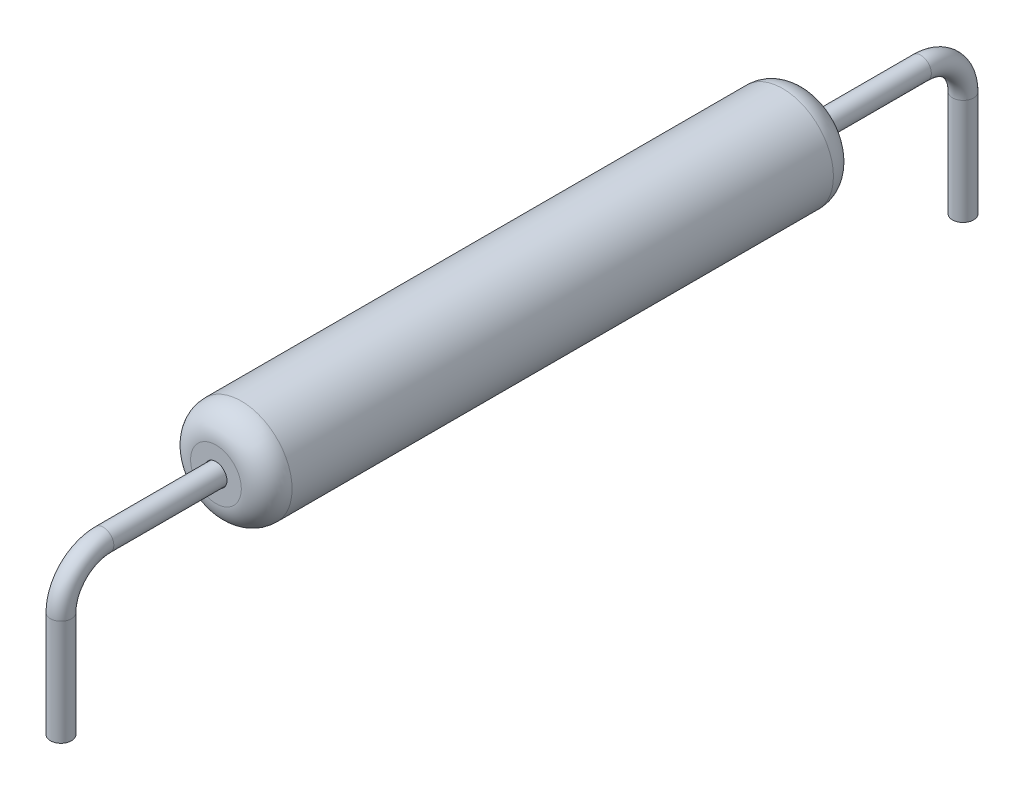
ISO-10303-21;
HEADER;
FILE_DESCRIPTION(('STEP AP214'),'2;1');
FILE_NAME('part.step','',(''),(''),'','','');
FILE_SCHEMA(('AUTOMOTIVE_DESIGN { 1 0 10303 214 1 1 1 1 }'));
ENDSEC;
DATA;
#1=APPLICATION_CONTEXT('core data for automotive mechanical design processes');
#2=APPLICATION_PROTOCOL_DEFINITION('international standard','automotive_design',2000,#1);
#3=PRODUCT_CONTEXT('',#1,'mechanical');
#4=PRODUCT('Part','Part','',(#3));
#5=PRODUCT_RELATED_PRODUCT_CATEGORY('part','',(#4));
#6=PRODUCT_DEFINITION_FORMATION('','',#4);
#7=PRODUCT_DEFINITION_CONTEXT('part definition',#1,'design');
#8=PRODUCT_DEFINITION('design','',#6,#7);
#9=PRODUCT_DEFINITION_SHAPE('','',#8);
#10=(LENGTH_UNIT() NAMED_UNIT(*) SI_UNIT(.MILLI.,.METRE.));
#11=(NAMED_UNIT(*) PLANE_ANGLE_UNIT() SI_UNIT($,.RADIAN.));
#12=(NAMED_UNIT(*) SI_UNIT($,.STERADIAN.) SOLID_ANGLE_UNIT());
#13=UNCERTAINTY_MEASURE_WITH_UNIT(LENGTH_MEASURE(1.E-05),#10,'distance_accuracy_value','');
#14=(GEOMETRIC_REPRESENTATION_CONTEXT(3) GLOBAL_UNCERTAINTY_ASSIGNED_CONTEXT((#13)) GLOBAL_UNIT_ASSIGNED_CONTEXT((#10,
#11,#12)) REPRESENTATION_CONTEXT('',''));
#15=CARTESIAN_POINT('',(0.,0.,0.));
#16=DIRECTION('',(0.,0.,1.));
#17=DIRECTION('',(1.,0.,0.));
#18=AXIS2_PLACEMENT_3D('',#15,#16,#17);
#19=CARTESIAN_POINT('',(0.,-1.00000000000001,17.665));
#20=DIRECTION('',(0.,-1.,0.));
#21=DIRECTION('',(0.,0.,-1.));
#22=AXIS2_PLACEMENT_3D('',#19,#20,#21);
#23=CYLINDRICAL_SURFACE('',#22,0.25);
#24=CARTESIAN_POINT('',(0.,-1.00000000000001,17.665));
#25=DIRECTION('',(0.,-1.,0.));
#26=DIRECTION('',(1.,0.,0.));
#27=AXIS2_PLACEMENT_3D('',#24,#25,#26);
#28=CIRCLE('',#27,0.25);
#29=CARTESIAN_POINT('',(0.,-1.00000000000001,17.915));
#30=VERTEX_POINT('',#29);
#31=EDGE_CURVE('E43',#30,#30,#28,.T.);
#32=ORIENTED_EDGE('',*,*,#31,.T.);
#33=EDGE_LOOP('',(#32));
#34=FACE_BOUND('',#33,.T.);
#35=CARTESIAN_POINT('',(0.,-3.5,17.665));
#36=DIRECTION('',(0.,-1.,0.));
#37=DIRECTION('',(1.,0.,0.));
#38=AXIS2_PLACEMENT_3D('',#35,#36,#37);
#39=CIRCLE('',#38,0.25);
#40=CARTESIAN_POINT('',(0.25,-3.5,17.665));
#41=VERTEX_POINT('',#40);
#42=EDGE_CURVE('E11',#41,#41,#39,.T.);
#43=ORIENTED_EDGE('',*,*,#42,.F.);
#44=EDGE_LOOP('',(#43));
#45=FACE_BOUND('',#44,.T.);
#46=ADVANCED_FACE('F37',(#34,#45),#23,.T.);
#47=CARTESIAN_POINT('',(0.,-1.,16.665));
#48=DIRECTION('',(1.,0.,0.));
#49=DIRECTION('',(0.,0.,-1.));
#50=AXIS2_PLACEMENT_3D('',#47,#48,#49);
#51=TOROIDAL_SURFACE('',#50,1.,0.25);
#52=CARTESIAN_POINT('',(0.,0.,16.665));
#53=DIRECTION('',(0.,0.,1.));
#54=DIRECTION('',(1.,0.,0.));
#55=AXIS2_PLACEMENT_3D('',#52,#53,#54);
#56=CIRCLE('',#55,0.25);
#57=CARTESIAN_POINT('',(0.,0.25,16.665));
#58=VERTEX_POINT('',#57);
#59=EDGE_CURVE('E47',#58,#58,#56,.T.);
#60=CARTESIAN_POINT('',(0.,-1.,16.665));
#61=DIRECTION('',(1.,0.,0.));
#62=DIRECTION('',(0.,0.,-1.));
#63=AXIS2_PLACEMENT_3D('',#60,#61,#62);
#64=CIRCLE('',#63,1.25);
#65=EDGE_CURVE('',#58,#30,#64,.T.);
#66=ORIENTED_EDGE('',*,*,#59,.T.);
#67=ORIENTED_EDGE('',*,*,#31,.F.);
#68=ORIENTED_EDGE('',*,*,#65,.T.);
#69=ORIENTED_EDGE('',*,*,#65,.F.);
#70=EDGE_LOOP('',(#66,#68,#67,#69));
#71=FACE_BOUND('',#70,.T.);
#72=ADVANCED_FACE('F84',(#71),#51,.T.);
#73=CARTESIAN_POINT('',(0.,0.,16.665));
#74=DIRECTION('',(0.,0.,-1.));
#75=DIRECTION('',(-1.,0.,0.));
#76=AXIS2_PLACEMENT_3D('',#73,#74,#75);
#77=CYLINDRICAL_SURFACE('',#76,0.25);
#78=ORIENTED_EDGE('',*,*,#59,.F.);
#79=EDGE_LOOP('',(#78));
#80=FACE_BOUND('',#79,.T.);
#81=CARTESIAN_POINT('',(0.,0.,-2.66499999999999));
#82=DIRECTION('',(0.,0.,1.));
#83=DIRECTION('',(1.,0.,0.));
#84=AXIS2_PLACEMENT_3D('',#81,#82,#83);
#85=CIRCLE('',#84,0.25);
#86=CARTESIAN_POINT('',(0.,0.25,-2.66499999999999));
#87=VERTEX_POINT('',#86);
#88=EDGE_CURVE('E59',#87,#87,#85,.T.);
#89=ORIENTED_EDGE('',*,*,#88,.T.);
#90=EDGE_LOOP('',(#89));
#91=FACE_BOUND('',#90,.T.);
#92=ADVANCED_FACE('F63',(#80,#91),#77,.T.);
#93=CARTESIAN_POINT('',(0.,-3.5,17.665));
#94=DIRECTION('',(0.,-1.,0.));
#95=DIRECTION('',(1.,0.,0.));
#96=AXIS2_PLACEMENT_3D('',#93,#94,#95);
#97=PLANE('',#96);
#98=ORIENTED_EDGE('',*,*,#42,.T.);
#99=EDGE_LOOP('',(#98));
#100=FACE_BOUND('',#99,.T.);
#101=ADVANCED_FACE('F75',(#100),#97,.T.);
#102=CARTESIAN_POINT('',(0.,-1.00000000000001,-3.665));
#103=DIRECTION('',(0.,-1.,0.));
#104=DIRECTION('',(0.,0.,-1.));
#105=AXIS2_PLACEMENT_3D('',#102,#103,#104);
#106=CYLINDRICAL_SURFACE('',#105,0.25);
#107=CARTESIAN_POINT('',(0.,-1.00000000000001,-3.665));
#108=DIRECTION('',(0.,1.,0.));
#109=DIRECTION('',(1.,0.,0.));
#110=AXIS2_PLACEMENT_3D('',#107,#108,#109);
#111=CIRCLE('',#110,0.25);
#112=CARTESIAN_POINT('',(0.,-1.00000000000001,-3.915));
#113=VERTEX_POINT('',#112);
#114=EDGE_CURVE('E56',#113,#113,#111,.T.);
#115=ORIENTED_EDGE('',*,*,#114,.F.);
#116=EDGE_LOOP('',(#115));
#117=FACE_BOUND('',#116,.T.);
#118=CARTESIAN_POINT('',(0.,-3.5,-3.665));
#119=DIRECTION('',(0.,1.,0.));
#120=DIRECTION('',(1.,0.,0.));
#121=AXIS2_PLACEMENT_3D('',#118,#119,#120);
#122=CIRCLE('',#121,0.25);
#123=CARTESIAN_POINT('',(0.25,-3.5,-3.665));
#124=VERTEX_POINT('',#123);
#125=EDGE_CURVE('E51',#124,#124,#122,.T.);
#126=ORIENTED_EDGE('',*,*,#125,.T.);
#127=EDGE_LOOP('',(#126));
#128=FACE_BOUND('',#127,.T.);
#129=ADVANCED_FACE('F69',(#117,#128),#106,.T.);
#130=CARTESIAN_POINT('',(0.,-1.,-2.665));
#131=DIRECTION('',(-1.,0.,0.));
#132=DIRECTION('',(0.,0.,1.));
#133=AXIS2_PLACEMENT_3D('',#130,#131,#132);
#134=TOROIDAL_SURFACE('',#133,1.,0.25);
#135=CARTESIAN_POINT('',(0.,-1.,-2.665));
#136=DIRECTION('',(-1.,0.,0.));
#137=DIRECTION('',(0.,0.,1.));
#138=AXIS2_PLACEMENT_3D('',#135,#136,#137);
#139=CIRCLE('',#138,1.25);
#140=EDGE_CURVE('',#87,#113,#139,.T.);
#141=ORIENTED_EDGE('',*,*,#88,.F.);
#142=ORIENTED_EDGE('',*,*,#114,.T.);
#143=ORIENTED_EDGE('',*,*,#140,.T.);
#144=ORIENTED_EDGE('',*,*,#140,.F.);
#145=EDGE_LOOP('',(#141,#143,#142,#144));
#146=FACE_BOUND('',#145,.T.);
#147=ADVANCED_FACE('F65',(#146),#134,.T.);
#148=CARTESIAN_POINT('',(0.,-3.5,-3.665));
#149=DIRECTION('',(0.,-1.,0.));
#150=DIRECTION('',(1.,0.,0.));
#151=AXIS2_PLACEMENT_3D('',#148,#149,#150);
#152=PLANE('',#151);
#153=ORIENTED_EDGE('',*,*,#125,.F.);
#154=EDGE_LOOP('',(#153));
#155=FACE_BOUND('',#154,.T.);
#156=ADVANCED_FACE('F68',(#155),#152,.T.);
#157=CLOSED_SHELL('',(#46,#72,#92,#101,#129,#147,#156));
#158=MANIFOLD_SOLID_BREP('B2',#157);
#159=CARTESIAN_POINT('',(0.,0.,14.));
#160=DIRECTION('',(0.,0.,1.));
#161=DIRECTION('',(1.,0.,0.));
#162=AXIS2_PLACEMENT_3D('',#159,#160,#161);
#163=PLANE('',#162);
#164=CARTESIAN_POINT('',(0.,0.,14.));
#165=DIRECTION('',(0.,0.,1.));
#166=DIRECTION('',(1.,0.,0.));
#167=AXIS2_PLACEMENT_3D('',#164,#165,#166);
#168=CIRCLE('',#167,0.6);
#169=CARTESIAN_POINT('',(0.6,0.,14.));
#170=VERTEX_POINT('',#169);
#171=EDGE_CURVE('E144',#170,#170,#168,.T.);
#172=ORIENTED_EDGE('',*,*,#171,.T.);
#173=EDGE_LOOP('',(#172));
#174=FACE_BOUND('',#173,.T.);
#175=CARTESIAN_POINT('',(0.,0.,14.));
#176=DIRECTION('',(0.,0.,1.));
#177=DIRECTION('',(1.,0.,0.));
#178=AXIS2_PLACEMENT_3D('',#175,#176,#177);
#179=CIRCLE('',#178,0.26);
#180=CARTESIAN_POINT('',(0.26,0.,14.));
#181=VERTEX_POINT('',#180);
#182=EDGE_CURVE('E149',#181,#181,#179,.T.);
#183=ORIENTED_EDGE('',*,*,#182,.F.);
#184=EDGE_LOOP('',(#183));
#185=FACE_BOUND('',#184,.T.);
#186=ADVANCED_FACE('F129',(#174,#185),#163,.T.);
#187=CARTESIAN_POINT('',(0.,0.,0.));
#188=DIRECTION('',(0.,0.,1.));
#189=DIRECTION('',(1.,0.,0.));
#190=AXIS2_PLACEMENT_3D('',#187,#188,#189);
#191=PLANE('',#190);
#192=CARTESIAN_POINT('',(0.,0.,0.));
#193=DIRECTION('',(0.,0.,1.));
#194=DIRECTION('',(1.,0.,0.));
#195=AXIS2_PLACEMENT_3D('',#192,#193,#194);
#196=CIRCLE('',#195,0.6);
#197=CARTESIAN_POINT('',(0.6,0.,0.));
#198=VERTEX_POINT('',#197);
#199=EDGE_CURVE('E36',#198,#198,#196,.F.);
#200=ORIENTED_EDGE('',*,*,#199,.T.);
#201=EDGE_LOOP('',(#200));
#202=FACE_BOUND('',#201,.T.);
#203=CARTESIAN_POINT('',(0.,0.,0.));
#204=DIRECTION('',(0.,0.,1.));
#205=DIRECTION('',(1.,0.,0.));
#206=AXIS2_PLACEMENT_3D('',#203,#204,#205);
#207=CIRCLE('',#206,0.26);
#208=CARTESIAN_POINT('',(0.26,0.,0.));
#209=VERTEX_POINT('',#208);
#210=EDGE_CURVE('E152',#209,#209,#207,.T.);
#211=ORIENTED_EDGE('',*,*,#210,.T.);
#212=EDGE_LOOP('',(#211));
#213=FACE_BOUND('',#212,.T.);
#214=ADVANCED_FACE('F156',(#202,#213),#191,.F.);
#215=CARTESIAN_POINT('',(0.,0.,14.));
#216=DIRECTION('',(0.,0.,-1.));
#217=DIRECTION('',(-1.,0.,0.));
#218=AXIS2_PLACEMENT_3D('',#215,#216,#217);
#219=CYLINDRICAL_SURFACE('',#218,1.2);
#220=CARTESIAN_POINT('',(0.,0.,13.4));
#221=DIRECTION('',(0.,0.,1.));
#222=DIRECTION('',(1.,0.,0.));
#223=AXIS2_PLACEMENT_3D('',#220,#221,#222);
#224=CIRCLE('',#223,1.2);
#225=CARTESIAN_POINT('',(1.2,0.,13.4));
#226=VERTEX_POINT('',#225);
#227=EDGE_CURVE('E136',#226,#226,#224,.F.);
#228=ORIENTED_EDGE('',*,*,#227,.T.);
#229=EDGE_LOOP('',(#228));
#230=FACE_BOUND('',#229,.T.);
#231=CARTESIAN_POINT('',(0.,0.,0.6));
#232=DIRECTION('',(0.,0.,1.));
#233=DIRECTION('',(1.,0.,0.));
#234=AXIS2_PLACEMENT_3D('',#231,#232,#233);
#235=CIRCLE('',#234,1.2);
#236=CARTESIAN_POINT('',(1.2,0.,0.6));
#237=VERTEX_POINT('',#236);
#238=EDGE_CURVE('E140',#237,#237,#235,.T.);
#239=ORIENTED_EDGE('',*,*,#238,.T.);
#240=EDGE_LOOP('',(#239));
#241=FACE_BOUND('',#240,.T.);
#242=ADVANCED_FACE('F131',(#230,#241),#219,.T.);
#243=CARTESIAN_POINT('',(0.,0.,14.));
#244=DIRECTION('',(0.,0.,-1.));
#245=DIRECTION('',(-1.,0.,0.));
#246=AXIS2_PLACEMENT_3D('',#243,#244,#245);
#247=CYLINDRICAL_SURFACE('',#246,0.26);
#248=ORIENTED_EDGE('',*,*,#182,.T.);
#249=EDGE_LOOP('',(#248));
#250=FACE_BOUND('',#249,.T.);
#251=ORIENTED_EDGE('',*,*,#210,.F.);
#252=EDGE_LOOP('',(#251));
#253=FACE_BOUND('',#252,.T.);
#254=ADVANCED_FACE('F158',(#250,#253),#247,.F.);
#255=CARTESIAN_POINT('',(0.,0.,13.4));
#256=DIRECTION('',(0.,0.,1.));
#257=DIRECTION('',(1.,0.,0.));
#258=AXIS2_PLACEMENT_3D('',#255,#256,#257);
#259=DEGENERATE_TOROIDAL_SURFACE('',#258,0.6,0.6,.T.);
#260=ORIENTED_EDGE('',*,*,#227,.F.);
#261=EDGE_LOOP('',(#260));
#262=FACE_BOUND('',#261,.T.);
#263=ORIENTED_EDGE('',*,*,#171,.F.);
#264=EDGE_LOOP('',(#263));
#265=FACE_BOUND('',#264,.T.);
#266=ADVANCED_FACE('F160',(#262,#265),#259,.T.);
#267=CARTESIAN_POINT('',(0.,0.,0.6));
#268=DIRECTION('',(0.,0.,1.));
#269=DIRECTION('',(1.,0.,0.));
#270=AXIS2_PLACEMENT_3D('',#267,#268,#269);
#271=DEGENERATE_TOROIDAL_SURFACE('',#270,0.6,0.6,.T.);
#272=ORIENTED_EDGE('',*,*,#199,.F.);
#273=EDGE_LOOP('',(#272));
#274=FACE_BOUND('',#273,.T.);
#275=ORIENTED_EDGE('',*,*,#238,.F.);
#276=EDGE_LOOP('',(#275));
#277=FACE_BOUND('',#276,.T.);
#278=ADVANCED_FACE('F167',(#274,#277),#271,.T.);
#279=CLOSED_SHELL('',(#186,#214,#242,#254,#266,#278));
#280=MANIFOLD_SOLID_BREP('B6',#279);
#281=ADVANCED_BREP_SHAPE_REPRESENTATION('',(#18,#158,#280),#14);
#282=SHAPE_DEFINITION_REPRESENTATION(#9,#281);
ENDSEC;
END-ISO-10303-21;
